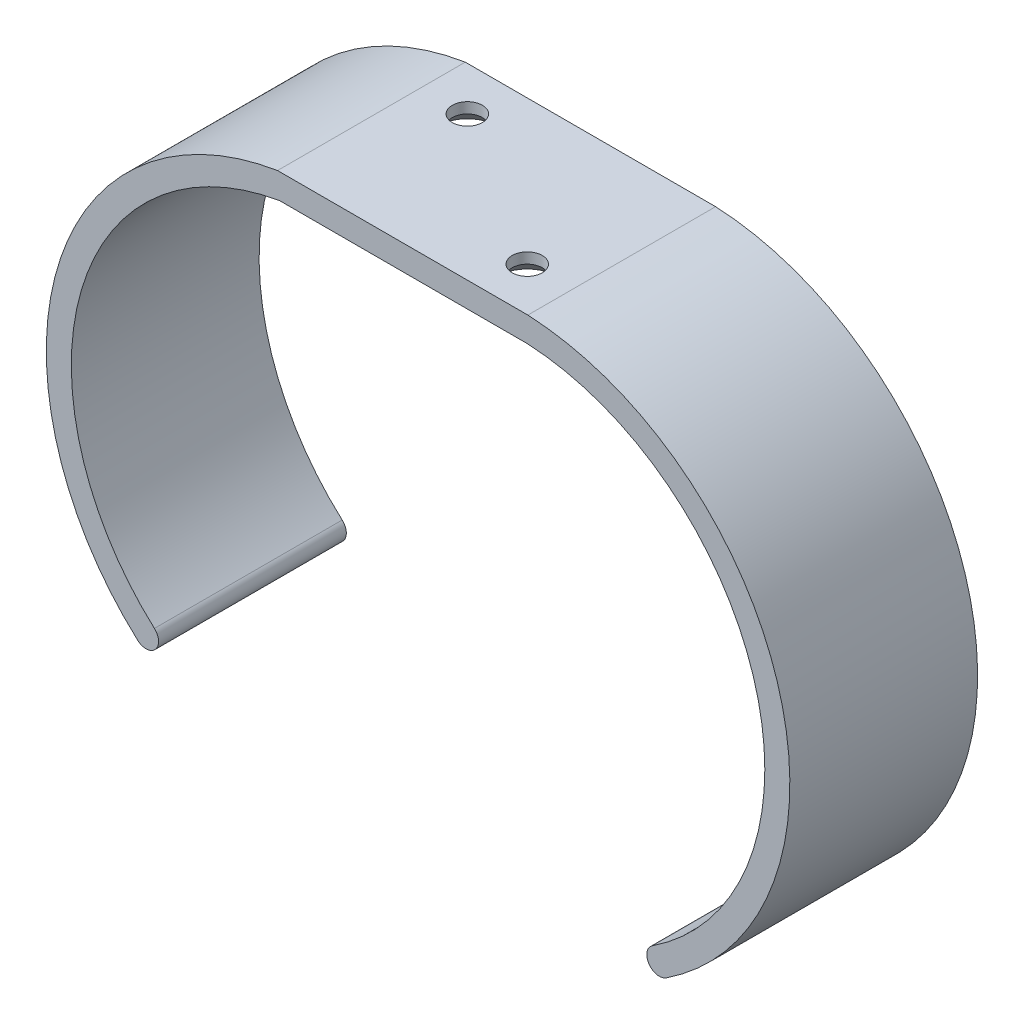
ISO-10303-21;
HEADER;
FILE_DESCRIPTION(('STEP AP214'),'2;1');
FILE_NAME('part.step','',(''),(''),'','','');
FILE_SCHEMA(('AUTOMOTIVE_DESIGN { 1 0 10303 214 1 1 1 1 }'));
ENDSEC;
DATA;
#1=APPLICATION_CONTEXT('core data for automotive mechanical design processes');
#2=APPLICATION_PROTOCOL_DEFINITION('international standard','automotive_design',2000,#1);
#3=PRODUCT_CONTEXT('',#1,'mechanical');
#4=PRODUCT('Part','Part','',(#3));
#5=PRODUCT_RELATED_PRODUCT_CATEGORY('part','',(#4));
#6=PRODUCT_DEFINITION_FORMATION('','',#4);
#7=PRODUCT_DEFINITION_CONTEXT('part definition',#1,'design');
#8=PRODUCT_DEFINITION('design','',#6,#7);
#9=PRODUCT_DEFINITION_SHAPE('','',#8);
#10=(LENGTH_UNIT() NAMED_UNIT(*) SI_UNIT(.MILLI.,.METRE.));
#11=(NAMED_UNIT(*) PLANE_ANGLE_UNIT() SI_UNIT($,.RADIAN.));
#12=(NAMED_UNIT(*) SI_UNIT($,.STERADIAN.) SOLID_ANGLE_UNIT());
#13=UNCERTAINTY_MEASURE_WITH_UNIT(LENGTH_MEASURE(1.E-05),#10,'distance_accuracy_value','');
#14=(GEOMETRIC_REPRESENTATION_CONTEXT(3) GLOBAL_UNCERTAINTY_ASSIGNED_CONTEXT((#13)) GLOBAL_UNIT_ASSIGNED_CONTEXT((#10,
#11,#12)) REPRESENTATION_CONTEXT('',''));
#15=CARTESIAN_POINT('',(0.,0.,0.));
#16=DIRECTION('',(0.,0.,1.));
#17=DIRECTION('',(1.,0.,0.));
#18=AXIS2_PLACEMENT_3D('',#15,#16,#17);
#19=CARTESIAN_POINT('',(6.7231740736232,-39.4309387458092,30.));
#20=DIRECTION('',(0.,0.,-1.));
#21=DIRECTION('',(-1.,0.,0.));
#22=AXIS2_PLACEMENT_3D('',#19,#20,#21);
#23=CYLINDRICAL_SURFACE('',#22,40.);
#24=CARTESIAN_POINT('',(6.7231740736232,-39.4309387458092,0.));
#25=DIRECTION('',(0.,0.,-1.));
#26=DIRECTION('',(1.,0.,0.));
#27=AXIS2_PLACEMENT_3D('',#24,#25,#26);
#28=CIRCLE('',#27,40.);
#29=CARTESIAN_POINT('',(-20.,-69.1945401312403,0.));
#30=VERTEX_POINT('',#29);
#31=CARTESIAN_POINT('',(0.,0.,0.));
#32=VERTEX_POINT('',#31);
#33=EDGE_CURVE('E129',#30,#32,#28,.T.);
#34=ORIENTED_EDGE('',*,*,#33,.T.);
#35=DIRECTION('',(0.,0.,-1.));
#36=VECTOR('',#35,1.);
#37=CARTESIAN_POINT('',(0.,0.,30.));
#38=LINE('',#37,#36);
#39=CARTESIAN_POINT('',(0.,0.,30.));
#40=VERTEX_POINT('',#39);
#41=EDGE_CURVE('E11',#40,#32,#38,.T.);
#42=ORIENTED_EDGE('',*,*,#41,.F.);
#43=CARTESIAN_POINT('',(6.7231740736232,-39.4309387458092,30.));
#44=DIRECTION('',(0.,0.,-1.));
#45=DIRECTION('',(1.,0.,0.));
#46=AXIS2_PLACEMENT_3D('',#43,#44,#45);
#47=CIRCLE('',#46,40.);
#48=CARTESIAN_POINT('',(-20.,-69.1945401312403,30.));
#49=VERTEX_POINT('',#48);
#50=EDGE_CURVE('E144',#49,#40,#47,.T.);
#51=ORIENTED_EDGE('',*,*,#50,.F.);
#52=DIRECTION('',(0.,0.,-1.));
#53=VECTOR('',#52,1.);
#54=CARTESIAN_POINT('',(-20.,-69.1945401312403,30.));
#55=LINE('',#54,#53);
#56=EDGE_CURVE('E125',#49,#30,#55,.T.);
#57=ORIENTED_EDGE('',*,*,#56,.T.);
#58=EDGE_LOOP('',(#34,#42,#51,#57));
#59=FACE_BOUND('',#58,.T.);
#60=ADVANCED_FACE('F33',(#59),#23,.F.);
#61=CARTESIAN_POINT('',(0.,0.,30.));
#62=DIRECTION('',(0.,1.,0.));
#63=DIRECTION('',(0.,0.,1.));
#64=AXIS2_PLACEMENT_3D('',#61,#62,#63);
#65=PLANE('',#64);
#66=CARTESIAN_POINT('',(32.5699111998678,0.,23.));
#67=DIRECTION('',(0.,-1.,0.));
#68=DIRECTION('',(0.,0.,-1.));
#69=AXIS2_PLACEMENT_3D('',#66,#67,#68);
#70=CIRCLE('',#69,4.7);
#71=CARTESIAN_POINT('',(32.5699111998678,0.,18.3));
#72=VERTEX_POINT('',#71);
#73=EDGE_CURVE('E191',#72,#72,#70,.T.);
#74=ORIENTED_EDGE('',*,*,#73,.F.);
#75=EDGE_LOOP('',(#74));
#76=FACE_BOUND('',#75,.T.);
#77=CARTESIAN_POINT('',(7.,0.,7.));
#78=DIRECTION('',(0.,-1.,0.));
#79=DIRECTION('',(0.,0.,-1.));
#80=AXIS2_PLACEMENT_3D('',#77,#78,#79);
#81=CIRCLE('',#80,4.7);
#82=CARTESIAN_POINT('',(7.,0.,2.3));
#83=VERTEX_POINT('',#82);
#84=EDGE_CURVE('E182',#83,#83,#81,.T.);
#85=ORIENTED_EDGE('',*,*,#84,.F.);
#86=EDGE_LOOP('',(#85));
#87=FACE_BOUND('',#86,.T.);
#88=DIRECTION('',(1.,0.,0.));
#89=VECTOR('',#88,1.);
#90=CARTESIAN_POINT('',(0.,0.,0.));
#91=LINE('',#90,#89);
#92=CARTESIAN_POINT('',(39.5699111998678,0.,0.));
#93=VERTEX_POINT('',#92);
#94=EDGE_CURVE('E132',#32,#93,#91,.T.);
#95=ORIENTED_EDGE('',*,*,#94,.T.);
#96=DIRECTION('',(0.,0.,-1.));
#97=VECTOR('',#96,1.);
#98=CARTESIAN_POINT('',(39.5699111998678,0.,30.));
#99=LINE('',#98,#97);
#100=CARTESIAN_POINT('',(39.5699111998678,0.,30.));
#101=VERTEX_POINT('',#100);
#102=EDGE_CURVE('E41',#101,#93,#99,.T.);
#103=ORIENTED_EDGE('',*,*,#102,.F.);
#104=DIRECTION('',(1.,0.,0.));
#105=VECTOR('',#104,1.);
#106=CARTESIAN_POINT('',(0.,0.,30.));
#107=LINE('',#106,#105);
#108=EDGE_CURVE('E92',#40,#101,#107,.T.);
#109=ORIENTED_EDGE('',*,*,#108,.F.);
#110=ORIENTED_EDGE('',*,*,#41,.T.);
#111=EDGE_LOOP('',(#95,#103,#109,#110));
#112=FACE_BOUND('',#111,.T.);
#113=ADVANCED_FACE('F197',(#76,#87,#112),#65,.F.);
#114=CARTESIAN_POINT('',(37.5297234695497,-39.9479365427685,30.));
#115=DIRECTION('',(0.,0.,-1.));
#116=DIRECTION('',(-1.,0.,0.));
#117=AXIS2_PLACEMENT_3D('',#114,#115,#116);
#118=CYLINDRICAL_SURFACE('',#117,40.);
#119=CARTESIAN_POINT('',(37.5297234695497,-39.9479365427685,0.));
#120=DIRECTION('',(0.,0.,-1.));
#121=DIRECTION('',(-1.,0.,0.));
#122=AXIS2_PLACEMENT_3D('',#119,#120,#121);
#123=CIRCLE('',#122,40.);
#124=CARTESIAN_POINT('',(59.5699111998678,-73.3280222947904,0.));
#125=VERTEX_POINT('',#124);
#126=EDGE_CURVE('E135',#93,#125,#123,.T.);
#127=ORIENTED_EDGE('',*,*,#126,.T.);
#128=DIRECTION('',(0.,0.,-1.));
#129=VECTOR('',#128,1.);
#130=CARTESIAN_POINT('',(59.5699111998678,-73.3280222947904,30.));
#131=LINE('',#130,#129);
#132=CARTESIAN_POINT('',(59.5699111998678,-73.3280222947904,30.));
#133=VERTEX_POINT('',#132);
#134=EDGE_CURVE('E151',#133,#125,#131,.T.);
#135=ORIENTED_EDGE('',*,*,#134,.F.);
#136=CARTESIAN_POINT('',(37.5297234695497,-39.9479365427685,30.));
#137=DIRECTION('',(0.,0.,-1.));
#138=DIRECTION('',(-1.,0.,0.));
#139=AXIS2_PLACEMENT_3D('',#136,#137,#138);
#140=CIRCLE('',#139,40.);
#141=EDGE_CURVE('E159',#101,#133,#140,.T.);
#142=ORIENTED_EDGE('',*,*,#141,.F.);
#143=ORIENTED_EDGE('',*,*,#102,.T.);
#144=EDGE_LOOP('',(#127,#135,#142,#143));
#145=FACE_BOUND('',#144,.T.);
#146=ADVANCED_FACE('F157',(#145),#118,.F.);
#147=CARTESIAN_POINT('',(60.6719205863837,-74.9970265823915,30.));
#148=DIRECTION('',(0.,0.,-1.));
#149=DIRECTION('',(-1.,0.,0.));
#150=AXIS2_PLACEMENT_3D('',#147,#148,#149);
#151=CYLINDRICAL_SURFACE('',#150,2.);
#152=CARTESIAN_POINT('',(60.6719205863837,-74.9970265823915,0.));
#153=DIRECTION('',(0.,0.,1.));
#154=DIRECTION('',(-1.,0.,0.));
#155=AXIS2_PLACEMENT_3D('',#152,#153,#154);
#156=CIRCLE('',#155,2.);
#157=CARTESIAN_POINT('',(61.7739299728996,-76.6660308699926,0.));
#158=VERTEX_POINT('',#157);
#159=EDGE_CURVE('E137',#125,#158,#156,.T.);
#160=ORIENTED_EDGE('',*,*,#159,.T.);
#161=DIRECTION('',(0.,0.,-1.));
#162=VECTOR('',#161,1.);
#163=CARTESIAN_POINT('',(61.7739299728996,-76.6660308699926,30.));
#164=LINE('',#163,#162);
#165=CARTESIAN_POINT('',(61.7739299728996,-76.6660308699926,30.));
#166=VERTEX_POINT('',#165);
#167=EDGE_CURVE('E148',#166,#158,#164,.T.);
#168=ORIENTED_EDGE('',*,*,#167,.F.);
#169=CARTESIAN_POINT('',(60.6719205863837,-74.9970265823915,30.));
#170=DIRECTION('',(0.,0.,1.));
#171=DIRECTION('',(-1.,0.,0.));
#172=AXIS2_PLACEMENT_3D('',#169,#170,#171);
#173=CIRCLE('',#172,2.);
#174=EDGE_CURVE('E171',#133,#166,#173,.T.);
#175=ORIENTED_EDGE('',*,*,#174,.F.);
#176=ORIENTED_EDGE('',*,*,#134,.T.);
#177=EDGE_LOOP('',(#160,#168,#175,#176));
#178=FACE_BOUND('',#177,.T.);
#179=ADVANCED_FACE('F167',(#178),#151,.T.);
#180=CARTESIAN_POINT('',(37.5297234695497,-39.9479365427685,30.));
#181=DIRECTION('',(0.,0.,-1.));
#182=DIRECTION('',(-1.,0.,0.));
#183=AXIS2_PLACEMENT_3D('',#180,#181,#182);
#184=CYLINDRICAL_SURFACE('',#183,44.);
#185=CARTESIAN_POINT('',(37.5297234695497,-39.9479365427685,0.));
#186=DIRECTION('',(0.,0.,1.));
#187=DIRECTION('',(-1.,0.,0.));
#188=AXIS2_PLACEMENT_3D('',#185,#186,#187);
#189=CIRCLE('',#188,44.);
#190=CARTESIAN_POINT('',(39.6695537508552,4.,0.));
#191=VERTEX_POINT('',#190);
#192=EDGE_CURVE('E139',#158,#191,#189,.T.);
#193=ORIENTED_EDGE('',*,*,#192,.T.);
#194=DIRECTION('',(0.,0.,-1.));
#195=VECTOR('',#194,1.);
#196=CARTESIAN_POINT('',(39.6695537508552,4.,30.));
#197=LINE('',#196,#195);
#198=CARTESIAN_POINT('',(39.6695537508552,4.,30.));
#199=VERTEX_POINT('',#198);
#200=EDGE_CURVE('E120',#199,#191,#197,.T.);
#201=ORIENTED_EDGE('',*,*,#200,.F.);
#202=CARTESIAN_POINT('',(37.5297234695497,-39.9479365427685,30.));
#203=DIRECTION('',(0.,0.,1.));
#204=DIRECTION('',(-1.,0.,0.));
#205=AXIS2_PLACEMENT_3D('',#202,#203,#204);
#206=CIRCLE('',#205,44.);
#207=EDGE_CURVE('E111',#166,#199,#206,.T.);
#208=ORIENTED_EDGE('',*,*,#207,.F.);
#209=ORIENTED_EDGE('',*,*,#167,.T.);
#210=EDGE_LOOP('',(#193,#201,#208,#209));
#211=FACE_BOUND('',#210,.T.);
#212=ADVANCED_FACE('F170',(#211),#184,.T.);
#213=CARTESIAN_POINT('',(-0.330446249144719,4.,30.));
#214=DIRECTION('',(0.,-1.,0.));
#215=DIRECTION('',(1.,0.,0.));
#216=AXIS2_PLACEMENT_3D('',#213,#214,#215);
#217=PLANE('',#216);
#218=CARTESIAN_POINT('',(32.5699111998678,4.,23.));
#219=DIRECTION('',(0.,-1.,0.));
#220=DIRECTION('',(0.,0.,-1.));
#221=AXIS2_PLACEMENT_3D('',#218,#219,#220);
#222=CIRCLE('',#221,2.4);
#223=CARTESIAN_POINT('',(32.5699111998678,4.,20.6));
#224=VERTEX_POINT('',#223);
#225=EDGE_CURVE('E185',#224,#224,#222,.T.);
#226=ORIENTED_EDGE('',*,*,#225,.T.);
#227=EDGE_LOOP('',(#226));
#228=FACE_BOUND('',#227,.T.);
#229=CARTESIAN_POINT('',(7.,4.,7.));
#230=DIRECTION('',(0.,-1.,0.));
#231=DIRECTION('',(0.,0.,-1.));
#232=AXIS2_PLACEMENT_3D('',#229,#230,#231);
#233=CIRCLE('',#232,2.4);
#234=CARTESIAN_POINT('',(7.,4.,4.6));
#235=VERTEX_POINT('',#234);
#236=EDGE_CURVE('E133',#235,#235,#233,.T.);
#237=ORIENTED_EDGE('',*,*,#236,.T.);
#238=EDGE_LOOP('',(#237));
#239=FACE_BOUND('',#238,.T.);
#240=DIRECTION('',(-1.,0.,0.));
#241=VECTOR('',#240,1.);
#242=CARTESIAN_POINT('',(-0.330446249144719,4.,0.));
#243=LINE('',#242,#241);
#244=CARTESIAN_POINT('',(-0.330446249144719,4.,0.));
#245=VERTEX_POINT('',#244);
#246=EDGE_CURVE('E119',#191,#245,#243,.T.);
#247=ORIENTED_EDGE('',*,*,#246,.T.);
#248=DIRECTION('',(0.,0.,-1.));
#249=VECTOR('',#248,1.);
#250=CARTESIAN_POINT('',(-0.330446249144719,4.,30.));
#251=LINE('',#250,#249);
#252=CARTESIAN_POINT('',(-0.330446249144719,4.,30.));
#253=VERTEX_POINT('',#252);
#254=EDGE_CURVE('E116',#253,#245,#251,.T.);
#255=ORIENTED_EDGE('',*,*,#254,.F.);
#256=DIRECTION('',(-1.,0.,0.));
#257=VECTOR('',#256,1.);
#258=CARTESIAN_POINT('',(-0.330446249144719,4.,30.));
#259=LINE('',#258,#257);
#260=EDGE_CURVE('E105',#199,#253,#259,.T.);
#261=ORIENTED_EDGE('',*,*,#260,.F.);
#262=ORIENTED_EDGE('',*,*,#200,.T.);
#263=EDGE_LOOP('',(#247,#255,#261,#262));
#264=FACE_BOUND('',#263,.T.);
#265=ADVANCED_FACE('F117',(#228,#239,#264),#217,.F.);
#266=CARTESIAN_POINT('',(6.7231740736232,-39.4309387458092,30.));
#267=DIRECTION('',(0.,0.,-1.));
#268=DIRECTION('',(-1.,0.,0.));
#269=AXIS2_PLACEMENT_3D('',#266,#267,#268);
#270=CYLINDRICAL_SURFACE('',#269,44.);
#271=CARTESIAN_POINT('',(6.7231740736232,-39.4309387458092,0.));
#272=DIRECTION('',(0.,0.,1.));
#273=DIRECTION('',(1.,0.,0.));
#274=AXIS2_PLACEMENT_3D('',#271,#272,#273);
#275=CIRCLE('',#274,44.);
#276=CARTESIAN_POINT('',(-22.6723174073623,-72.1709002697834,0.));
#277=VERTEX_POINT('',#276);
#278=EDGE_CURVE('E78',#245,#277,#275,.T.);
#279=ORIENTED_EDGE('',*,*,#278,.T.);
#280=DIRECTION('',(0.,0.,-1.));
#281=VECTOR('',#280,1.);
#282=CARTESIAN_POINT('',(-22.6723174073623,-72.1709002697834,30.));
#283=LINE('',#282,#281);
#284=CARTESIAN_POINT('',(-22.6723174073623,-72.1709002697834,30.));
#285=VERTEX_POINT('',#284);
#286=EDGE_CURVE('E121',#285,#277,#283,.T.);
#287=ORIENTED_EDGE('',*,*,#286,.F.);
#288=CARTESIAN_POINT('',(6.7231740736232,-39.4309387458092,30.));
#289=DIRECTION('',(0.,0.,1.));
#290=DIRECTION('',(1.,0.,0.));
#291=AXIS2_PLACEMENT_3D('',#288,#289,#290);
#292=CIRCLE('',#291,44.);
#293=EDGE_CURVE('E109',#253,#285,#292,.T.);
#294=ORIENTED_EDGE('',*,*,#293,.F.);
#295=ORIENTED_EDGE('',*,*,#254,.T.);
#296=EDGE_LOOP('',(#279,#287,#294,#295));
#297=FACE_BOUND('',#296,.T.);
#298=ADVANCED_FACE('F123',(#297),#270,.T.);
#299=CARTESIAN_POINT('',(-21.3361587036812,-70.6827202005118,30.));
#300=DIRECTION('',(0.,0.,-1.));
#301=DIRECTION('',(-1.,0.,0.));
#302=AXIS2_PLACEMENT_3D('',#299,#300,#301);
#303=CYLINDRICAL_SURFACE('',#302,2.);
#304=CARTESIAN_POINT('',(-21.3361587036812,-70.6827202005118,0.));
#305=DIRECTION('',(0.,0.,1.));
#306=DIRECTION('',(-1.,0.,0.));
#307=AXIS2_PLACEMENT_3D('',#304,#305,#306);
#308=CIRCLE('',#307,2.);
#309=EDGE_CURVE('E84',#277,#30,#308,.T.);
#310=ORIENTED_EDGE('',*,*,#309,.T.);
#311=ORIENTED_EDGE('',*,*,#56,.F.);
#312=CARTESIAN_POINT('',(-21.3361587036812,-70.6827202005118,30.));
#313=DIRECTION('',(0.,0.,1.));
#314=DIRECTION('',(-1.,0.,0.));
#315=AXIS2_PLACEMENT_3D('',#312,#313,#314);
#316=CIRCLE('',#315,2.);
#317=EDGE_CURVE('E49',#285,#49,#316,.T.);
#318=ORIENTED_EDGE('',*,*,#317,.F.);
#319=ORIENTED_EDGE('',*,*,#286,.T.);
#320=EDGE_LOOP('',(#310,#311,#318,#319));
#321=FACE_BOUND('',#320,.T.);
#322=ADVANCED_FACE('F204',(#321),#303,.T.);
#323=CARTESIAN_POINT('',(6.7231740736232,-39.4309387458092,30.));
#324=DIRECTION('',(0.,0.,1.));
#325=DIRECTION('',(1.,0.,0.));
#326=AXIS2_PLACEMENT_3D('',#323,#324,#325);
#327=PLANE('',#326);
#328=ORIENTED_EDGE('',*,*,#50,.T.);
#329=ORIENTED_EDGE('',*,*,#108,.T.);
#330=ORIENTED_EDGE('',*,*,#141,.T.);
#331=ORIENTED_EDGE('',*,*,#174,.T.);
#332=ORIENTED_EDGE('',*,*,#207,.T.);
#333=ORIENTED_EDGE('',*,*,#260,.T.);
#334=ORIENTED_EDGE('',*,*,#293,.T.);
#335=ORIENTED_EDGE('',*,*,#317,.T.);
#336=EDGE_LOOP('',(#328,#329,#330,#331,#332,#333,#334,#335));
#337=FACE_BOUND('',#336,.T.);
#338=ADVANCED_FACE('F107',(#337),#327,.T.);
#339=CARTESIAN_POINT('',(6.7231740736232,-39.4309387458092,0.));
#340=DIRECTION('',(0.,0.,1.));
#341=DIRECTION('',(1.,0.,0.));
#342=AXIS2_PLACEMENT_3D('',#339,#340,#341);
#343=PLANE('',#342);
#344=ORIENTED_EDGE('',*,*,#33,.F.);
#345=ORIENTED_EDGE('',*,*,#309,.F.);
#346=ORIENTED_EDGE('',*,*,#278,.F.);
#347=ORIENTED_EDGE('',*,*,#246,.F.);
#348=ORIENTED_EDGE('',*,*,#192,.F.);
#349=ORIENTED_EDGE('',*,*,#159,.F.);
#350=ORIENTED_EDGE('',*,*,#126,.F.);
#351=ORIENTED_EDGE('',*,*,#94,.F.);
#352=EDGE_LOOP('',(#344,#345,#346,#347,#348,#349,#350,#351));
#353=FACE_BOUND('',#352,.T.);
#354=ADVANCED_FACE('F163',(#353),#343,.F.);
#355=CARTESIAN_POINT('',(7.,0.,7.));
#356=DIRECTION('',(0.,-1.,0.));
#357=DIRECTION('',(0.,0.,-1.));
#358=AXIS2_PLACEMENT_3D('',#355,#356,#357);
#359=CYLINDRICAL_SURFACE('',#358,2.4);
#360=ORIENTED_EDGE('',*,*,#236,.F.);
#361=EDGE_LOOP('',(#360));
#362=FACE_BOUND('',#361,.T.);
#363=CARTESIAN_POINT('',(7.,2.3,7.));
#364=DIRECTION('',(0.,-1.,0.));
#365=DIRECTION('',(0.,0.,-1.));
#366=AXIS2_PLACEMENT_3D('',#363,#364,#365);
#367=CIRCLE('',#366,2.4);
#368=CARTESIAN_POINT('',(7.,2.3,4.6));
#369=VERTEX_POINT('',#368);
#370=EDGE_CURVE('E179',#369,#369,#367,.T.);
#371=ORIENTED_EDGE('',*,*,#370,.T.);
#372=EDGE_LOOP('',(#371));
#373=FACE_BOUND('',#372,.T.);
#374=ADVANCED_FACE('F269',(#362,#373),#359,.F.);
#375=CARTESIAN_POINT('',(7.,0.,7.));
#376=DIRECTION('',(0.,-1.,0.));
#377=DIRECTION('',(0.,0.,-1.));
#378=AXIS2_PLACEMENT_3D('',#375,#376,#377);
#379=CONICAL_SURFACE('',#378,4.7,0.785398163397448);
#380=ORIENTED_EDGE('',*,*,#370,.F.);
#381=EDGE_LOOP('',(#380));
#382=FACE_BOUND('',#381,.T.);
#383=ORIENTED_EDGE('',*,*,#84,.T.);
#384=EDGE_LOOP('',(#383));
#385=FACE_BOUND('',#384,.T.);
#386=ADVANCED_FACE('F277',(#382,#385),#379,.F.);
#387=CARTESIAN_POINT('',(32.5699111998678,0.,23.));
#388=DIRECTION('',(0.,-1.,0.));
#389=DIRECTION('',(0.,0.,-1.));
#390=AXIS2_PLACEMENT_3D('',#387,#388,#389);
#391=CYLINDRICAL_SURFACE('',#390,2.4);
#392=ORIENTED_EDGE('',*,*,#225,.F.);
#393=EDGE_LOOP('',(#392));
#394=FACE_BOUND('',#393,.T.);
#395=CARTESIAN_POINT('',(32.5699111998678,2.3,23.));
#396=DIRECTION('',(0.,-1.,0.));
#397=DIRECTION('',(0.,0.,-1.));
#398=AXIS2_PLACEMENT_3D('',#395,#396,#397);
#399=CIRCLE('',#398,2.4);
#400=CARTESIAN_POINT('',(32.5699111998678,2.3,20.6));
#401=VERTEX_POINT('',#400);
#402=EDGE_CURVE('E188',#401,#401,#399,.T.);
#403=ORIENTED_EDGE('',*,*,#402,.T.);
#404=EDGE_LOOP('',(#403));
#405=FACE_BOUND('',#404,.T.);
#406=ADVANCED_FACE('F284',(#394,#405),#391,.F.);
#407=CARTESIAN_POINT('',(32.5699111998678,0.,23.));
#408=DIRECTION('',(0.,-1.,0.));
#409=DIRECTION('',(0.,0.,-1.));
#410=AXIS2_PLACEMENT_3D('',#407,#408,#409);
#411=CONICAL_SURFACE('',#410,4.7,0.785398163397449);
#412=ORIENTED_EDGE('',*,*,#402,.F.);
#413=EDGE_LOOP('',(#412));
#414=FACE_BOUND('',#413,.T.);
#415=ORIENTED_EDGE('',*,*,#73,.T.);
#416=EDGE_LOOP('',(#415));
#417=FACE_BOUND('',#416,.T.);
#418=ADVANCED_FACE('F195',(#414,#417),#411,.F.);
#419=CLOSED_SHELL('',(#60,#113,#146,#179,#212,#265,#298,#322,#338,#354,#374,#386,#406,#418));
#420=MANIFOLD_SOLID_BREP('B2',#419);
#421=ADVANCED_BREP_SHAPE_REPRESENTATION('',(#18,#420),#14);
#422=SHAPE_DEFINITION_REPRESENTATION(#9,#421);
ENDSEC;
END-ISO-10303-21;
